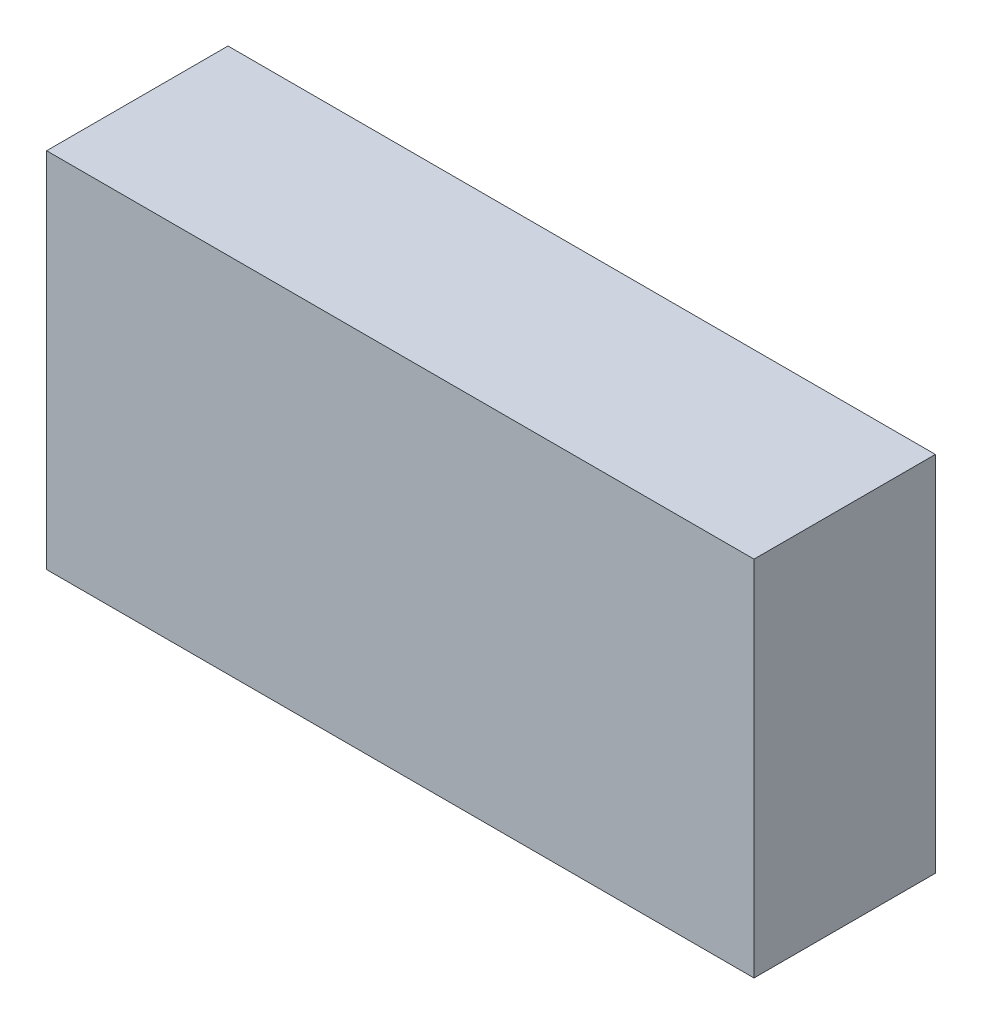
ISO-10303-21;
HEADER;
FILE_DESCRIPTION(('STEP AP214'),'2;1');
FILE_NAME('part.step','',(''),(''),'','','');
FILE_SCHEMA(('AUTOMOTIVE_DESIGN { 1 0 10303 214 1 1 1 1 }'));
ENDSEC;
DATA;
#1=APPLICATION_CONTEXT('core data for automotive mechanical design processes');
#2=APPLICATION_PROTOCOL_DEFINITION('international standard','automotive_design',2000,#1);
#3=PRODUCT_CONTEXT('',#1,'mechanical');
#4=PRODUCT('Part','Part','',(#3));
#5=PRODUCT_RELATED_PRODUCT_CATEGORY('part','',(#4));
#6=PRODUCT_DEFINITION_FORMATION('','',#4);
#7=PRODUCT_DEFINITION_CONTEXT('part definition',#1,'design');
#8=PRODUCT_DEFINITION('design','',#6,#7);
#9=PRODUCT_DEFINITION_SHAPE('','',#8);
#10=(LENGTH_UNIT() NAMED_UNIT(*) SI_UNIT(.MILLI.,.METRE.));
#11=(NAMED_UNIT(*) PLANE_ANGLE_UNIT() SI_UNIT($,.RADIAN.));
#12=(NAMED_UNIT(*) SI_UNIT($,.STERADIAN.) SOLID_ANGLE_UNIT());
#13=UNCERTAINTY_MEASURE_WITH_UNIT(LENGTH_MEASURE(1.E-05),#10,'distance_accuracy_value','');
#14=(GEOMETRIC_REPRESENTATION_CONTEXT(3) GLOBAL_UNCERTAINTY_ASSIGNED_CONTEXT((#13)) GLOBAL_UNIT_ASSIGNED_CONTEXT((#10,
#11,#12)) REPRESENTATION_CONTEXT('',''));
#15=CARTESIAN_POINT('',(0.,0.,0.));
#16=DIRECTION('',(0.,0.,1.));
#17=DIRECTION('',(1.,0.,0.));
#18=AXIS2_PLACEMENT_3D('',#15,#16,#17);
#19=CARTESIAN_POINT('',(-0.97499932,0.499999,0.));
#20=DIRECTION('',(1.,0.,0.));
#21=DIRECTION('',(0.,-1.,0.));
#22=AXIS2_PLACEMENT_3D('',#19,#20,#21);
#23=PLANE('',#22);
#24=DIRECTION('',(0.,-1.,0.));
#25=VECTOR('',#24,1.);
#26=CARTESIAN_POINT('',(-0.97499932,0.499999,0.));
#27=LINE('',#26,#25);
#28=CARTESIAN_POINT('',(-0.97499932,0.499999,0.));
#29=VERTEX_POINT('',#28);
#30=CARTESIAN_POINT('',(-0.97499932,-0.499999,0.));
#31=VERTEX_POINT('',#30);
#32=EDGE_CURVE('E11',#29,#31,#27,.T.);
#33=ORIENTED_EDGE('',*,*,#32,.T.);
#34=DIRECTION('',(0.,0.,1.));
#35=VECTOR('',#34,1.);
#36=CARTESIAN_POINT('',(-0.97499932,-0.499999,0.));
#37=LINE('',#36,#35);
#38=CARTESIAN_POINT('',(-0.97499932,-0.499999,0.499999));
#39=VERTEX_POINT('',#38);
#40=EDGE_CURVE('E24',#31,#39,#37,.T.);
#41=ORIENTED_EDGE('',*,*,#40,.T.);
#42=DIRECTION('',(0.,-1.,0.));
#43=VECTOR('',#42,1.);
#44=CARTESIAN_POINT('',(-0.97499932,0.499999,0.499999));
#45=LINE('',#44,#43);
#46=CARTESIAN_POINT('',(-0.97499932,0.499999,0.499999));
#47=VERTEX_POINT('',#46);
#48=EDGE_CURVE('E87',#47,#39,#45,.T.);
#49=ORIENTED_EDGE('',*,*,#48,.F.);
#50=DIRECTION('',(0.,0.,1.));
#51=VECTOR('',#50,1.);
#52=CARTESIAN_POINT('',(-0.97499932,0.499999,0.));
#53=LINE('',#52,#51);
#54=EDGE_CURVE('E36',#29,#47,#53,.T.);
#55=ORIENTED_EDGE('',*,*,#54,.F.);
#56=EDGE_LOOP('',(#33,#41,#49,#55));
#57=FACE_BOUND('',#56,.T.);
#58=ADVANCED_FACE('F17',(#57),#23,.F.);
#59=CARTESIAN_POINT('',(-0.97499932,-0.499999,0.));
#60=DIRECTION('',(0.,1.,0.));
#61=DIRECTION('',(1.,0.,0.));
#62=AXIS2_PLACEMENT_3D('',#59,#60,#61);
#63=PLANE('',#62);
#64=DIRECTION('',(1.,0.,0.));
#65=VECTOR('',#64,1.);
#66=CARTESIAN_POINT('',(-0.97499932,-0.499999,0.));
#67=LINE('',#66,#65);
#68=CARTESIAN_POINT('',(0.97499932,-0.499999,0.));
#69=VERTEX_POINT('',#68);
#70=EDGE_CURVE('E84',#31,#69,#67,.T.);
#71=ORIENTED_EDGE('',*,*,#70,.T.);
#72=DIRECTION('',(0.,0.,1.));
#73=VECTOR('',#72,1.);
#74=CARTESIAN_POINT('',(0.97499932,-0.499999,0.));
#75=LINE('',#74,#73);
#76=CARTESIAN_POINT('',(0.97499932,-0.499999,0.499999));
#77=VERTEX_POINT('',#76);
#78=EDGE_CURVE('E82',#69,#77,#75,.T.);
#79=ORIENTED_EDGE('',*,*,#78,.T.);
#80=DIRECTION('',(1.,0.,0.));
#81=VECTOR('',#80,1.);
#82=CARTESIAN_POINT('',(-0.97499932,-0.499999,0.499999));
#83=LINE('',#82,#81);
#84=EDGE_CURVE('E61',#39,#77,#83,.T.);
#85=ORIENTED_EDGE('',*,*,#84,.F.);
#86=ORIENTED_EDGE('',*,*,#40,.F.);
#87=EDGE_LOOP('',(#71,#79,#85,#86));
#88=FACE_BOUND('',#87,.T.);
#89=ADVANCED_FACE('F89',(#88),#63,.F.);
#90=CARTESIAN_POINT('',(0.97499932,-0.499999,0.));
#91=DIRECTION('',(-1.,0.,0.));
#92=DIRECTION('',(0.,1.,0.));
#93=AXIS2_PLACEMENT_3D('',#90,#91,#92);
#94=PLANE('',#93);
#95=DIRECTION('',(0.,1.,0.));
#96=VECTOR('',#95,1.);
#97=CARTESIAN_POINT('',(0.97499932,-0.499999,0.));
#98=LINE('',#97,#96);
#99=CARTESIAN_POINT('',(0.97499932,0.499999,0.));
#100=VERTEX_POINT('',#99);
#101=EDGE_CURVE('E71',#69,#100,#98,.T.);
#102=ORIENTED_EDGE('',*,*,#101,.T.);
#103=DIRECTION('',(0.,0.,1.));
#104=VECTOR('',#103,1.);
#105=CARTESIAN_POINT('',(0.97499932,0.499999,0.));
#106=LINE('',#105,#104);
#107=CARTESIAN_POINT('',(0.97499932,0.499999,0.499999));
#108=VERTEX_POINT('',#107);
#109=EDGE_CURVE('E65',#100,#108,#106,.T.);
#110=ORIENTED_EDGE('',*,*,#109,.T.);
#111=DIRECTION('',(0.,1.,0.));
#112=VECTOR('',#111,1.);
#113=CARTESIAN_POINT('',(0.97499932,-0.499999,0.499999));
#114=LINE('',#113,#112);
#115=EDGE_CURVE('E56',#77,#108,#114,.T.);
#116=ORIENTED_EDGE('',*,*,#115,.F.);
#117=ORIENTED_EDGE('',*,*,#78,.F.);
#118=EDGE_LOOP('',(#102,#110,#116,#117));
#119=FACE_BOUND('',#118,.T.);
#120=ADVANCED_FACE('F69',(#119),#94,.F.);
#121=CARTESIAN_POINT('',(0.97499932,0.499999,0.));
#122=DIRECTION('',(0.,-1.,0.));
#123=DIRECTION('',(-1.,0.,0.));
#124=AXIS2_PLACEMENT_3D('',#121,#122,#123);
#125=PLANE('',#124);
#126=DIRECTION('',(-1.,0.,0.));
#127=VECTOR('',#126,1.);
#128=CARTESIAN_POINT('',(0.97499932,0.499999,0.));
#129=LINE('',#128,#127);
#130=EDGE_CURVE('E66',#100,#29,#129,.T.);
#131=ORIENTED_EDGE('',*,*,#130,.T.);
#132=ORIENTED_EDGE('',*,*,#54,.T.);
#133=DIRECTION('',(-1.,0.,0.));
#134=VECTOR('',#133,1.);
#135=CARTESIAN_POINT('',(0.97499932,0.499999,0.499999));
#136=LINE('',#135,#134);
#137=EDGE_CURVE('E60',#108,#47,#136,.T.);
#138=ORIENTED_EDGE('',*,*,#137,.F.);
#139=ORIENTED_EDGE('',*,*,#109,.F.);
#140=EDGE_LOOP('',(#131,#132,#138,#139));
#141=FACE_BOUND('',#140,.T.);
#142=ADVANCED_FACE('F76',(#141),#125,.F.);
#143=CARTESIAN_POINT('',(-0.97499932,0.499999,0.));
#144=DIRECTION('',(0.,0.,-1.));
#145=DIRECTION('',(-1.,0.,0.));
#146=AXIS2_PLACEMENT_3D('',#143,#144,#145);
#147=PLANE('',#146);
#148=ORIENTED_EDGE('',*,*,#130,.F.);
#149=ORIENTED_EDGE('',*,*,#101,.F.);
#150=ORIENTED_EDGE('',*,*,#70,.F.);
#151=ORIENTED_EDGE('',*,*,#32,.F.);
#152=EDGE_LOOP('',(#148,#149,#150,#151));
#153=FACE_BOUND('',#152,.T.);
#154=ADVANCED_FACE('F91',(#153),#147,.T.);
#155=CARTESIAN_POINT('',(-0.97499932,0.499999,0.499999));
#156=DIRECTION('',(0.,0.,-1.));
#157=DIRECTION('',(-1.,0.,0.));
#158=AXIS2_PLACEMENT_3D('',#155,#156,#157);
#159=PLANE('',#158);
#160=ORIENTED_EDGE('',*,*,#48,.T.);
#161=ORIENTED_EDGE('',*,*,#84,.T.);
#162=ORIENTED_EDGE('',*,*,#115,.T.);
#163=ORIENTED_EDGE('',*,*,#137,.T.);
#164=EDGE_LOOP('',(#160,#161,#162,#163));
#165=FACE_BOUND('',#164,.T.);
#166=ADVANCED_FACE('F58',(#165),#159,.F.);
#167=CLOSED_SHELL('',(#58,#89,#120,#142,#154,#166));
#168=MANIFOLD_SOLID_BREP('B1',#167);
#169=ADVANCED_BREP_SHAPE_REPRESENTATION('',(#18,#168),#14);
#170=SHAPE_DEFINITION_REPRESENTATION(#9,#169);
ENDSEC;
END-ISO-10303-21;
